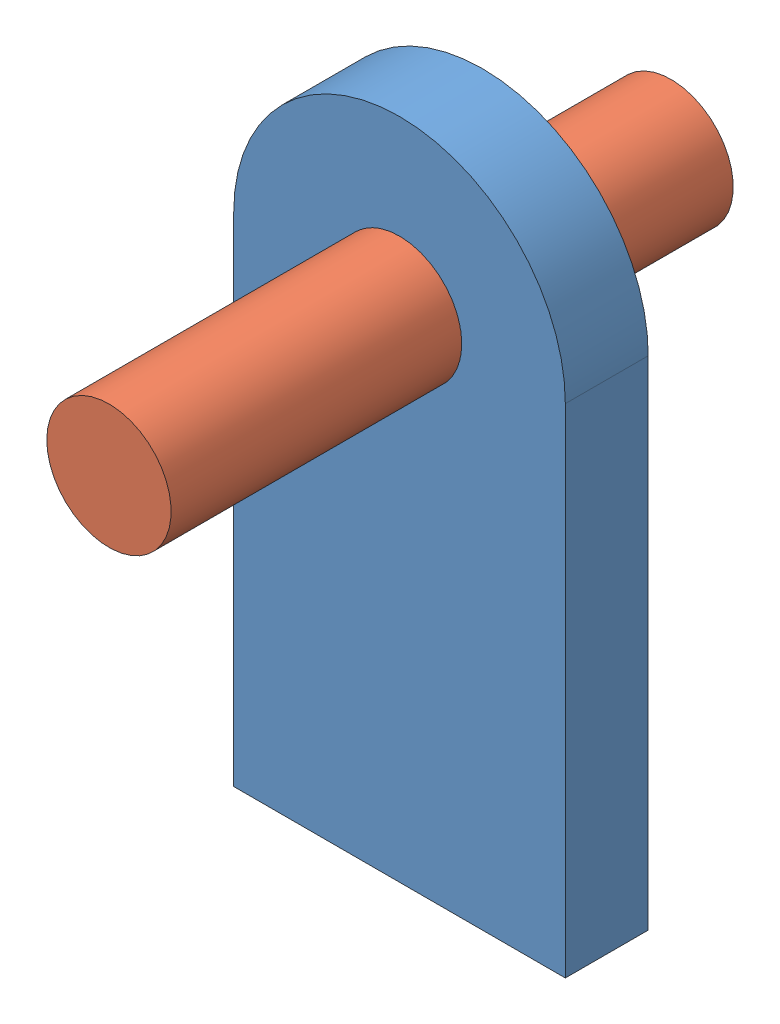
SolidWorks assembly bearing.SLDASM, configuration Default (file format 3400). Lengths in mm.
Overall size (50.8 101.6 86.11).
2 component instances, 2 part files, 1 mates.
Components (placement in the parent):
- center-1: center.SLDPRT [Default] at origin size (50.8 101.6 12.7)
- shaft section-1: shaft section.SLDPRT [Default] at (0 76.2 -35.2439) size (19.05 19.05 86.11)
Mates (geometry in assembly coordinates):
- Concentric1: concentric anti-aligned: cylinder of ?; cylinder of ?
